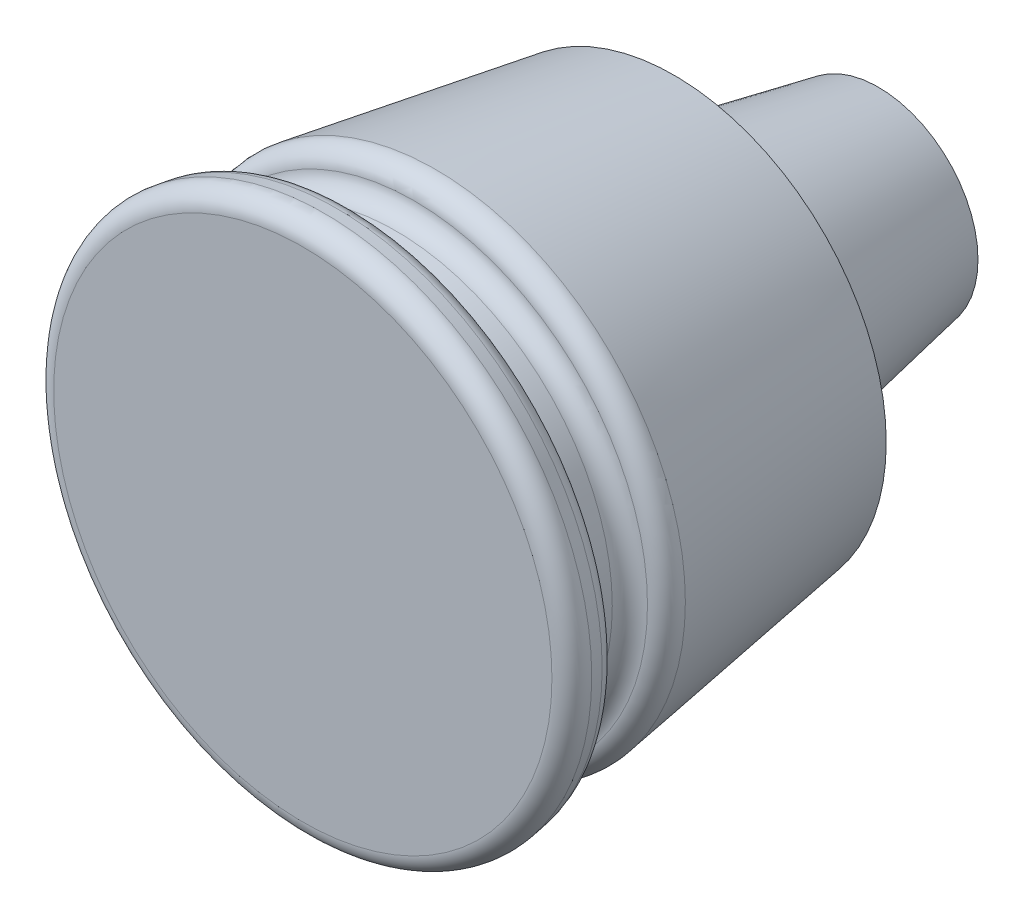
ISO-10303-21;
HEADER;
FILE_DESCRIPTION(('STEP AP214'),'2;1');
FILE_NAME('part.step','',(''),(''),'','','');
FILE_SCHEMA(('AUTOMOTIVE_DESIGN { 1 0 10303 214 1 1 1 1 }'));
ENDSEC;
DATA;
#1=APPLICATION_CONTEXT('core data for automotive mechanical design processes');
#2=APPLICATION_PROTOCOL_DEFINITION('international standard','automotive_design',2000,#1);
#3=PRODUCT_CONTEXT('',#1,'mechanical');
#4=PRODUCT('Part','Part','',(#3));
#5=PRODUCT_RELATED_PRODUCT_CATEGORY('part','',(#4));
#6=PRODUCT_DEFINITION_FORMATION('','',#4);
#7=PRODUCT_DEFINITION_CONTEXT('part definition',#1,'design');
#8=PRODUCT_DEFINITION('design','',#6,#7);
#9=PRODUCT_DEFINITION_SHAPE('','',#8);
#10=(LENGTH_UNIT() NAMED_UNIT(*) SI_UNIT(.MILLI.,.METRE.));
#11=(NAMED_UNIT(*) PLANE_ANGLE_UNIT() SI_UNIT($,.RADIAN.));
#12=(NAMED_UNIT(*) SI_UNIT($,.STERADIAN.) SOLID_ANGLE_UNIT());
#13=UNCERTAINTY_MEASURE_WITH_UNIT(LENGTH_MEASURE(1.E-05),#10,'distance_accuracy_value','');
#14=(GEOMETRIC_REPRESENTATION_CONTEXT(3) GLOBAL_UNCERTAINTY_ASSIGNED_CONTEXT((#13)) GLOBAL_UNIT_ASSIGNED_CONTEXT((#10,
#11,#12)) REPRESENTATION_CONTEXT('',''));
#15=CARTESIAN_POINT('',(0.,0.,0.));
#16=DIRECTION('',(0.,0.,1.));
#17=DIRECTION('',(1.,0.,0.));
#18=AXIS2_PLACEMENT_3D('',#15,#16,#17);
#19=CARTESIAN_POINT('',(0.,0.,0.));
#20=DIRECTION('',(0.,0.,1.));
#21=DIRECTION('',(1.,0.,0.));
#22=AXIS2_PLACEMENT_3D('',#19,#20,#21);
#23=CONICAL_SURFACE('',#22,34.259042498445,0.15707963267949);
#24=CARTESIAN_POINT('',(0.,0.,38.5604361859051));
#25=DIRECTION('',(0.,0.,1.));
#26=DIRECTION('',(1.,0.,0.));
#27=AXIS2_PLACEMENT_3D('',#24,#25,#26);
#28=CIRCLE('',#27,40.3664156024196);
#29=CARTESIAN_POINT('',(40.3664156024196,0.,38.5604361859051));
#30=VERTEX_POINT('',#29);
#31=EDGE_CURVE('E58',#30,#30,#28,.F.);
#32=ORIENTED_EDGE('',*,*,#31,.T.);
#33=EDGE_LOOP('',(#32));
#34=FACE_BOUND('',#33,.T.);
#35=CARTESIAN_POINT('',(0.,0.,0.));
#36=DIRECTION('',(0.,0.,1.));
#37=DIRECTION('',(1.,0.,0.));
#38=AXIS2_PLACEMENT_3D('',#35,#36,#37);
#39=CIRCLE('',#38,34.259042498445);
#40=CARTESIAN_POINT('',(34.259042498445,0.,0.));
#41=VERTEX_POINT('',#40);
#42=EDGE_CURVE('E70',#41,#41,#39,.T.);
#43=ORIENTED_EDGE('',*,*,#42,.T.);
#44=EDGE_LOOP('',(#43));
#45=FACE_BOUND('',#44,.T.);
#46=ADVANCED_FACE('F38',(#34,#45),#23,.T.);
#47=CARTESIAN_POINT('',(0.,0.,0.));
#48=DIRECTION('',(0.,0.,1.));
#49=DIRECTION('',(1.,0.,0.));
#50=AXIS2_PLACEMENT_3D('',#47,#48,#49);
#51=CONICAL_SURFACE('',#50,22.5,0.191986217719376);
#52=CARTESIAN_POINT('',(0.,0.,-32.999999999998));
#53=DIRECTION('',(0.,0.,1.));
#54=DIRECTION('',(1.,0.,0.));
#55=AXIS2_PLACEMENT_3D('',#52,#53,#54);
#56=CIRCLE('',#55,16.0854497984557);
#57=CARTESIAN_POINT('',(16.0854497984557,0.,-32.999999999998));
#58=VERTEX_POINT('',#57);
#59=EDGE_CURVE('E64',#58,#58,#56,.F.);
#60=ORIENTED_EDGE('',*,*,#59,.F.);
#61=EDGE_LOOP('',(#60));
#62=FACE_BOUND('',#61,.T.);
#63=CARTESIAN_POINT('',(0.,0.,0.));
#64=DIRECTION('',(0.,0.,1.));
#65=DIRECTION('',(1.,0.,0.));
#66=AXIS2_PLACEMENT_3D('',#63,#64,#65);
#67=CIRCLE('',#66,22.5);
#68=CARTESIAN_POINT('',(22.5,0.,0.));
#69=VERTEX_POINT('',#68);
#70=EDGE_CURVE('E67',#69,#69,#67,.T.);
#71=ORIENTED_EDGE('',*,*,#70,.F.);
#72=EDGE_LOOP('',(#71));
#73=FACE_BOUND('',#72,.T.);
#74=ADVANCED_FACE('F101',(#62,#73),#51,.T.);
#75=CARTESIAN_POINT('',(0.,0.,-32.999999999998));
#76=DIRECTION('',(0.,0.,1.));
#77=DIRECTION('',(1.,0.,0.));
#78=AXIS2_PLACEMENT_3D('',#75,#76,#77);
#79=PLANE('',#78);
#80=ORIENTED_EDGE('',*,*,#59,.T.);
#81=EDGE_LOOP('',(#80));
#82=FACE_BOUND('',#81,.T.);
#83=ADVANCED_FACE('F108',(#82),#79,.F.);
#84=CARTESIAN_POINT('',(0.,0.,0.));
#85=DIRECTION('',(0.,0.,1.));
#86=DIRECTION('',(1.,0.,0.));
#87=AXIS2_PLACEMENT_3D('',#84,#85,#86);
#88=PLANE('',#87);
#89=ORIENTED_EDGE('',*,*,#70,.T.);
#90=EDGE_LOOP('',(#89));
#91=FACE_BOUND('',#90,.T.);
#92=ORIENTED_EDGE('',*,*,#42,.F.);
#93=EDGE_LOOP('',(#92));
#94=FACE_BOUND('',#93,.T.);
#95=ADVANCED_FACE('F137',(#91,#94),#88,.F.);
#96=CARTESIAN_POINT('',(0.,-38.,52.));
#97=DIRECTION('',(0.,0.,-1.));
#98=DIRECTION('',(-1.,0.,0.));
#99=AXIS2_PLACEMENT_3D('',#96,#97,#98);
#100=PLANE('',#99);
#101=CARTESIAN_POINT('',(0.,0.,52.));
#102=DIRECTION('',(0.,0.,-1.));
#103=DIRECTION('',(-1.,0.,0.));
#104=AXIS2_PLACEMENT_3D('',#101,#102,#103);
#105=CIRCLE('',#104,39.9327913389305);
#106=CARTESIAN_POINT('',(-39.9327913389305,0.,52.));
#107=VERTEX_POINT('',#106);
#108=EDGE_CURVE('E53',#107,#107,#105,.T.);
#109=ORIENTED_EDGE('',*,*,#108,.T.);
#110=EDGE_LOOP('',(#109));
#111=FACE_BOUND('',#110,.T.);
#112=CARTESIAN_POINT('',(0.,0.,52.));
#113=DIRECTION('',(0.,0.,-1.));
#114=DIRECTION('',(-1.,0.,0.));
#115=AXIS2_PLACEMENT_3D('',#112,#113,#114);
#116=CIRCLE('',#115,38.);
#117=CARTESIAN_POINT('',(-38.,0.,52.));
#118=VERTEX_POINT('',#117);
#119=EDGE_CURVE('E73',#118,#118,#116,.T.);
#120=ORIENTED_EDGE('',*,*,#119,.F.);
#121=EDGE_LOOP('',(#120));
#122=FACE_BOUND('',#121,.T.);
#123=ADVANCED_FACE('F97',(#111,#122),#100,.T.);
#124=CARTESIAN_POINT('',(0.,0.,49.));
#125=DIRECTION('',(0.,0.,-1.));
#126=DIRECTION('',(-1.,0.,0.));
#127=AXIS2_PLACEMENT_3D('',#124,#125,#126);
#128=TOROIDAL_SURFACE('',#127,38.,3.);
#129=ORIENTED_EDGE('',*,*,#119,.T.);
#130=EDGE_LOOP('',(#129));
#131=FACE_BOUND('',#130,.T.);
#132=CARTESIAN_POINT('',(0.,0.,49.));
#133=DIRECTION('',(0.,0.,-1.));
#134=DIRECTION('',(-1.,0.,0.));
#135=AXIS2_PLACEMENT_3D('',#132,#133,#134);
#136=CIRCLE('',#135,35.);
#137=CARTESIAN_POINT('',(-35.,0.,49.));
#138=VERTEX_POINT('',#137);
#139=EDGE_CURVE('E76',#138,#138,#136,.T.);
#140=ORIENTED_EDGE('',*,*,#139,.F.);
#141=EDGE_LOOP('',(#140));
#142=FACE_BOUND('',#141,.T.);
#143=ADVANCED_FACE('F87',(#131,#142),#128,.F.);
#144=CARTESIAN_POINT('',(0.,0.,0.));
#145=DIRECTION('',(0.,0.,-1.));
#146=DIRECTION('',(-1.,0.,0.));
#147=AXIS2_PLACEMENT_3D('',#144,#145,#146);
#148=CYLINDRICAL_SURFACE('',#147,35.);
#149=ORIENTED_EDGE('',*,*,#139,.T.);
#150=EDGE_LOOP('',(#149));
#151=FACE_BOUND('',#150,.T.);
#152=CARTESIAN_POINT('',(0.,0.,45.));
#153=DIRECTION('',(0.,0.,-1.));
#154=DIRECTION('',(-1.,0.,0.));
#155=AXIS2_PLACEMENT_3D('',#152,#153,#154);
#156=CIRCLE('',#155,35.);
#157=CARTESIAN_POINT('',(-35.,0.,45.));
#158=VERTEX_POINT('',#157);
#159=EDGE_CURVE('E79',#158,#158,#156,.T.);
#160=ORIENTED_EDGE('',*,*,#159,.F.);
#161=EDGE_LOOP('',(#160));
#162=FACE_BOUND('',#161,.T.);
#163=ADVANCED_FACE('F85',(#151,#162),#148,.T.);
#164=CARTESIAN_POINT('',(0.,0.,45.));
#165=DIRECTION('',(0.,0.,-1.));
#166=DIRECTION('',(-1.,0.,0.));
#167=AXIS2_PLACEMENT_3D('',#164,#165,#166);
#168=TOROIDAL_SURFACE('',#167,38.,3.);
#169=CARTESIAN_POINT('',(0.,0.,42.0148697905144));
#170=DIRECTION('',(0.,0.,1.));
#171=DIRECTION('',(1.,0.,0.));
#172=AXIS2_PLACEMENT_3D('',#169,#170,#171);
#173=CIRCLE('',#172,37.7016752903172);
#174=CARTESIAN_POINT('',(37.7016752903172,0.,42.0148697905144));
#175=VERTEX_POINT('',#174);
#176=EDGE_CURVE('E61',#175,#175,#173,.T.);
#177=ORIENTED_EDGE('',*,*,#176,.T.);
#178=EDGE_LOOP('',(#177));
#179=FACE_BOUND('',#178,.T.);
#180=ORIENTED_EDGE('',*,*,#159,.T.);
#181=EDGE_LOOP('',(#180));
#182=FACE_BOUND('',#181,.T.);
#183=ADVANCED_FACE('F83',(#179,#182),#168,.F.);
#184=CARTESIAN_POINT('',(0.,0.,60.));
#185=DIRECTION('',(0.,0.,1.));
#186=DIRECTION('',(1.,0.,0.));
#187=AXIS2_PLACEMENT_3D('',#184,#185,#186);
#188=PLANE('',#187);
#189=CARTESIAN_POINT('',(0.,0.,60.));
#190=DIRECTION('',(0.,0.,1.));
#191=DIRECTION('',(1.,0.,0.));
#192=AXIS2_PLACEMENT_3D('',#189,#190,#191);
#193=CIRCLE('',#192,40.2495602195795);
#194=CARTESIAN_POINT('',(40.2495602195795,0.,60.));
#195=VERTEX_POINT('',#194);
#196=EDGE_CURVE('E11',#195,#195,#193,.T.);
#197=ORIENTED_EDGE('',*,*,#196,.T.);
#198=EDGE_LOOP('',(#197));
#199=FACE_BOUND('',#198,.T.);
#200=ADVANCED_FACE('F94',(#199),#188,.T.);
#201=CARTESIAN_POINT('',(0.,0.,54.5306966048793));
#202=DIRECTION('',(0.,0.,1.));
#203=DIRECTION('',(1.,0.,0.));
#204=AXIS2_PLACEMENT_3D('',#201,#202,#203);
#205=CIRCLE('',#204,42.8958563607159);
#206=CARTESIAN_POINT('',(42.8958563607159,0.,54.5306966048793));
#207=VERTEX_POINT('',#206);
#208=EDGE_CURVE('E45',#207,#207,#205,.T.);
#209=ORIENTED_EDGE('',*,*,#208,.T.);
#210=EDGE_LOOP('',(#209));
#211=FACE_BOUND('',#210,.T.);
#212=CARTESIAN_POINT('',(0.,0.,56.5306966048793));
#213=DIRECTION('',(0.,0.,1.));
#214=DIRECTION('',(1.,0.,0.));
#215=AXIS2_PLACEMENT_3D('',#212,#213,#214);
#216=CIRCLE('',#215,43.212625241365);
#217=CARTESIAN_POINT('',(43.212625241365,0.,56.5306966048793));
#218=VERTEX_POINT('',#217);
#219=EDGE_CURVE('E49',#218,#218,#216,.F.);
#220=ORIENTED_EDGE('',*,*,#219,.T.);
#221=EDGE_LOOP('',(#220));
#222=FACE_BOUND('',#221,.T.);
#223=ADVANCED_FACE('F104',(#211,#222),#23,.T.);
#224=CARTESIAN_POINT('',(0.,0.,39.0297395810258));
#225=DIRECTION('',(0.,0.,-1.));
#226=DIRECTION('',(-1.,0.,0.));
#227=AXIS2_PLACEMENT_3D('',#224,#225,#226);
#228=TOROIDAL_SURFACE('',#227,37.4033505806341,3.);
#229=ORIENTED_EDGE('',*,*,#31,.F.);
#230=EDGE_LOOP('',(#229));
#231=FACE_BOUND('',#230,.T.);
#232=ORIENTED_EDGE('',*,*,#176,.F.);
#233=EDGE_LOOP('',(#232));
#234=FACE_BOUND('',#233,.T.);
#235=ADVANCED_FACE('F114',(#231,#234),#228,.T.);
#236=CARTESIAN_POINT('',(0.,0.,55.));
#237=DIRECTION('',(0.,0.,-1.));
#238=DIRECTION('',(-1.,0.,0.));
#239=AXIS2_PLACEMENT_3D('',#236,#237,#238);
#240=TOROIDAL_SURFACE('',#239,39.9327913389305,3.);
#241=ORIENTED_EDGE('',*,*,#208,.F.);
#242=EDGE_LOOP('',(#241));
#243=FACE_BOUND('',#242,.T.);
#244=ORIENTED_EDGE('',*,*,#108,.F.);
#245=EDGE_LOOP('',(#244));
#246=FACE_BOUND('',#245,.T.);
#247=ADVANCED_FACE('F119',(#243,#246),#240,.T.);
#248=CARTESIAN_POINT('',(0.,0.,57.));
#249=DIRECTION('',(0.,0.,1.));
#250=DIRECTION('',(1.,0.,0.));
#251=AXIS2_PLACEMENT_3D('',#248,#249,#250);
#252=TOROIDAL_SURFACE('',#251,40.2495602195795,3.);
#253=ORIENTED_EDGE('',*,*,#219,.F.);
#254=EDGE_LOOP('',(#253));
#255=FACE_BOUND('',#254,.T.);
#256=ORIENTED_EDGE('',*,*,#196,.F.);
#257=EDGE_LOOP('',(#256));
#258=FACE_BOUND('',#257,.T.);
#259=ADVANCED_FACE('F40',(#255,#258),#252,.T.);
#260=CLOSED_SHELL('',(#46,#74,#83,#95,#123,#143,#163,#183,#200,#223,#235,#247,#259));
#261=MANIFOLD_SOLID_BREP('B2',#260);
#262=ADVANCED_BREP_SHAPE_REPRESENTATION('',(#18,#261),#14);
#263=SHAPE_DEFINITION_REPRESENTATION(#9,#262);
ENDSEC;
END-ISO-10303-21;
